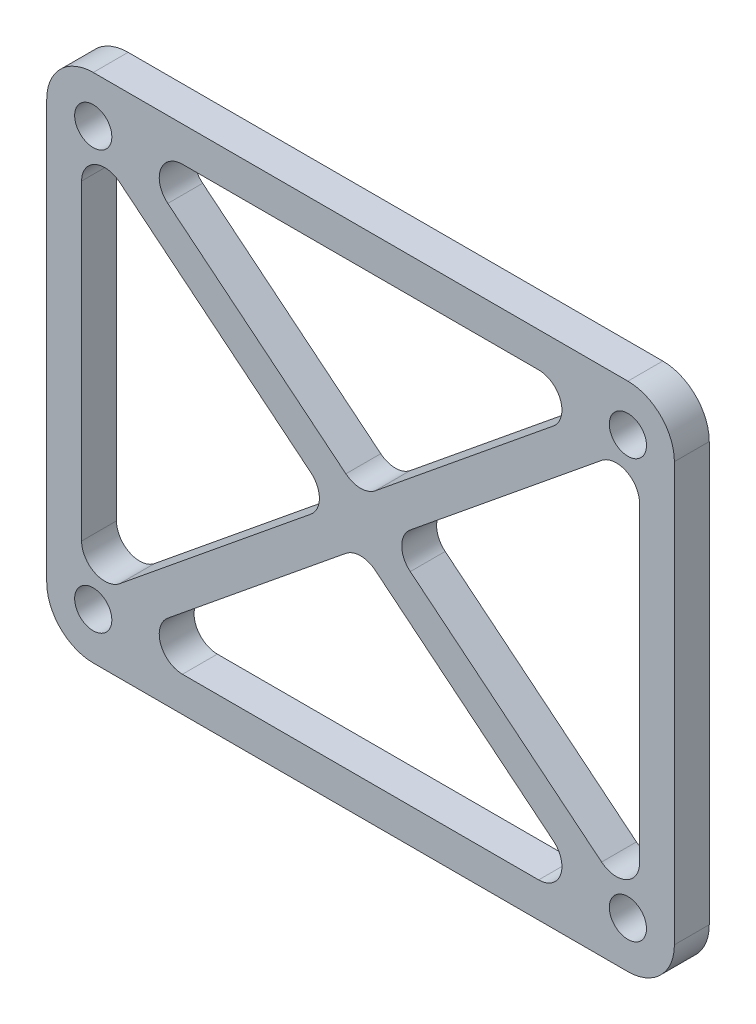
ISO-10303-21;
HEADER;
FILE_DESCRIPTION(('STEP AP214'),'2;1');
FILE_NAME('part.step','',(''),(''),'','','');
FILE_SCHEMA(('AUTOMOTIVE_DESIGN { 1 0 10303 214 1 1 1 1 }'));
ENDSEC;
DATA;
#1=APPLICATION_CONTEXT('core data for automotive mechanical design processes');
#2=APPLICATION_PROTOCOL_DEFINITION('international standard','automotive_design',2000,#1);
#3=PRODUCT_CONTEXT('',#1,'mechanical');
#4=PRODUCT('Part','Part','',(#3));
#5=PRODUCT_RELATED_PRODUCT_CATEGORY('part','',(#4));
#6=PRODUCT_DEFINITION_FORMATION('','',#4);
#7=PRODUCT_DEFINITION_CONTEXT('part definition',#1,'design');
#8=PRODUCT_DEFINITION('design','',#6,#7);
#9=PRODUCT_DEFINITION_SHAPE('','',#8);
#10=(LENGTH_UNIT() NAMED_UNIT(*) SI_UNIT(.MILLI.,.METRE.));
#11=(NAMED_UNIT(*) PLANE_ANGLE_UNIT() SI_UNIT($,.RADIAN.));
#12=(NAMED_UNIT(*) SI_UNIT($,.STERADIAN.) SOLID_ANGLE_UNIT());
#13=UNCERTAINTY_MEASURE_WITH_UNIT(LENGTH_MEASURE(1.E-05),#10,'distance_accuracy_value','');
#14=(GEOMETRIC_REPRESENTATION_CONTEXT(3) GLOBAL_UNCERTAINTY_ASSIGNED_CONTEXT((#13)) GLOBAL_UNIT_ASSIGNED_CONTEXT((#10,
#11,#12)) REPRESENTATION_CONTEXT('',''));
#15=CARTESIAN_POINT('',(0.,0.,0.));
#16=DIRECTION('',(0.,0.,1.));
#17=DIRECTION('',(1.,0.,0.));
#18=AXIS2_PLACEMENT_3D('',#15,#16,#17);
#19=CARTESIAN_POINT('',(0.,0.,3.));
#20=DIRECTION('',(0.,0.,-1.));
#21=DIRECTION('',(-1.,0.,0.));
#22=AXIS2_PLACEMENT_3D('',#19,#20,#21);
#23=PLANE('',#22);
#24=DIRECTION('',(-0.77523498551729,-0.631672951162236,0.));
#25=VECTOR('',#24,1.);
#26=CARTESIAN_POINT('',(0.947509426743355,-1.16285247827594,3.));
#27=LINE('',#26,#25);
#28=CARTESIAN_POINT('',(20.7366540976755,14.9616357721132,3.));
#29=VERTEX_POINT('',#28);
#30=CARTESIAN_POINT('',(4.27749606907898,1.55046997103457,3.));
#31=VERTEX_POINT('',#30);
#32=EDGE_CURVE('E285',#29,#31,#27,.T.);
#33=ORIENTED_EDGE('',*,*,#32,.F.);
#34=CARTESIAN_POINT('',(22.,13.4111658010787,3.));
#35=DIRECTION('',(0.,0.,-1.));
#36=DIRECTION('',(-1.,0.,0.));
#37=AXIS2_PLACEMENT_3D('',#34,#35,#36);
#38=CIRCLE('',#37,2.);
#39=CARTESIAN_POINT('',(24.,13.4111658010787,3.));
#40=VERTEX_POINT('',#39);
#41=EDGE_CURVE('E253',#40,#29,#38,.F.);
#42=ORIENTED_EDGE('',*,*,#41,.F.);
#43=DIRECTION('',(0.,-1.,0.));
#44=VECTOR('',#43,1.);
#45=CARTESIAN_POINT('',(24.,0.,3.));
#46=LINE('',#45,#44);
#47=CARTESIAN_POINT('',(24.,-13.4111658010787,3.));
#48=VERTEX_POINT('',#47);
#49=EDGE_CURVE('E271',#40,#48,#46,.T.);
#50=ORIENTED_EDGE('',*,*,#49,.T.);
#51=CARTESIAN_POINT('',(22.,-13.4111658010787,3.));
#52=DIRECTION('',(0.,0.,-1.));
#53=DIRECTION('',(-1.,0.,0.));
#54=AXIS2_PLACEMENT_3D('',#51,#52,#53);
#55=CIRCLE('',#54,2.);
#56=CARTESIAN_POINT('',(20.7366540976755,-14.9616357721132,3.));
#57=VERTEX_POINT('',#56);
#58=EDGE_CURVE('E274',#48,#57,#55,.T.);
#59=ORIENTED_EDGE('',*,*,#58,.T.);
#60=DIRECTION('',(0.77523498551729,-0.631672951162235,0.));
#61=VECTOR('',#60,1.);
#62=CARTESIAN_POINT('',(0.947509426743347,1.16285247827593,3.));
#63=LINE('',#62,#61);
#64=CARTESIAN_POINT('',(4.27749606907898,-1.55046997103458,3.));
#65=VERTEX_POINT('',#64);
#66=EDGE_CURVE('E290',#65,#57,#63,.T.);
#67=ORIENTED_EDGE('',*,*,#66,.F.);
#68=CARTESIAN_POINT('',(5.54084197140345,0.,3.));
#69=DIRECTION('',(0.,0.,-1.));
#70=DIRECTION('',(-1.,0.,0.));
#71=AXIS2_PLACEMENT_3D('',#68,#69,#70);
#72=CIRCLE('',#71,2.);
#73=EDGE_CURVE('E287',#31,#65,#72,.F.);
#74=ORIENTED_EDGE('',*,*,#73,.F.);
#75=EDGE_LOOP('',(#33,#42,#50,#59,#67,#74));
#76=FACE_BOUND('',#75,.T.);
#77=DIRECTION('',(-1.,0.,0.));
#78=VECTOR('',#77,1.);
#79=CARTESIAN_POINT('',(15.3227943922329,-19.,3.));
#80=LINE('',#79,#78);
#81=CARTESIAN_POINT('',(15.3227943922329,-19.,3.));
#82=VERTEX_POINT('',#81);
#83=CARTESIAN_POINT('',(-15.3227943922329,-19.,3.));
#84=VERTEX_POINT('',#83);
#85=EDGE_CURVE('E309',#82,#84,#80,.T.);
#86=ORIENTED_EDGE('',*,*,#85,.T.);
#87=CARTESIAN_POINT('',(-15.3227943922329,-17.,3.));
#88=DIRECTION('',(0.,0.,1.));
#89=DIRECTION('',(-1.,0.,0.));
#90=AXIS2_PLACEMENT_3D('',#87,#88,#89);
#91=CIRCLE('',#90,2.);
#92=CARTESIAN_POINT('',(-16.5861402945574,-15.4495300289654,3.));
#93=VERTEX_POINT('',#92);
#94=EDGE_CURVE('E297',#93,#84,#91,.T.);
#95=ORIENTED_EDGE('',*,*,#94,.F.);
#96=DIRECTION('',(0.775234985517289,0.631672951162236,0.));
#97=VECTOR('',#96,1.);
#98=CARTESIAN_POINT('',(-16.5861402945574,-15.4495300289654,3.));
#99=LINE('',#98,#97);
#100=CARTESIAN_POINT('',(-1.26334590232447,-2.96429015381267,3.));
#101=VERTEX_POINT('',#100);
#102=EDGE_CURVE('E322',#93,#101,#99,.T.);
#103=ORIENTED_EDGE('',*,*,#102,.T.);
#104=CARTESIAN_POINT('',(0.,-4.51476012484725,3.));
#105=DIRECTION('',(0.,0.,-1.));
#106=DIRECTION('',(1.,0.,0.));
#107=AXIS2_PLACEMENT_3D('',#104,#105,#106);
#108=CIRCLE('',#107,2.);
#109=CARTESIAN_POINT('',(1.26334590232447,-2.96429015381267,3.));
#110=VERTEX_POINT('',#109);
#111=EDGE_CURVE('E325',#101,#110,#108,.T.);
#112=ORIENTED_EDGE('',*,*,#111,.T.);
#113=DIRECTION('',(0.77523498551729,-0.631672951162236,0.));
#114=VECTOR('',#113,1.);
#115=CARTESIAN_POINT('',(1.26334590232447,-2.96429015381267,3.));
#116=LINE('',#115,#114);
#117=CARTESIAN_POINT('',(16.5861402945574,-15.4495300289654,3.));
#118=VERTEX_POINT('',#117);
#119=EDGE_CURVE('E328',#110,#118,#116,.T.);
#120=ORIENTED_EDGE('',*,*,#119,.T.);
#121=CARTESIAN_POINT('',(15.3227943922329,-17.,3.));
#122=DIRECTION('',(0.,0.,-1.));
#123=DIRECTION('',(1.,0.,0.));
#124=AXIS2_PLACEMENT_3D('',#121,#122,#123);
#125=CIRCLE('',#124,2.);
#126=EDGE_CURVE('E331',#118,#82,#125,.T.);
#127=ORIENTED_EDGE('',*,*,#126,.T.);
#128=EDGE_LOOP('',(#86,#95,#103,#112,#120,#127));
#129=FACE_BOUND('',#128,.T.);
#130=CARTESIAN_POINT('',(-15.3227943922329,17.,3.));
#131=DIRECTION('',(0.,0.,-1.));
#132=DIRECTION('',(-1.,0.,0.));
#133=AXIS2_PLACEMENT_3D('',#130,#131,#132);
#134=CIRCLE('',#133,2.);
#135=CARTESIAN_POINT('',(-16.5861402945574,15.4495300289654,3.));
#136=VERTEX_POINT('',#135);
#137=CARTESIAN_POINT('',(-15.3227943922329,19.,3.));
#138=VERTEX_POINT('',#137);
#139=EDGE_CURVE('E384',#136,#138,#134,.T.);
#140=ORIENTED_EDGE('',*,*,#139,.T.);
#141=DIRECTION('',(-1.,0.,0.));
#142=VECTOR('',#141,1.);
#143=CARTESIAN_POINT('',(15.3227943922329,19.,3.));
#144=LINE('',#143,#142);
#145=CARTESIAN_POINT('',(15.3227943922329,19.,3.));
#146=VERTEX_POINT('',#145);
#147=EDGE_CURVE('E416',#146,#138,#144,.T.);
#148=ORIENTED_EDGE('',*,*,#147,.F.);
#149=CARTESIAN_POINT('',(15.3227943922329,17.,3.));
#150=DIRECTION('',(0.,0.,1.));
#151=DIRECTION('',(1.,0.,0.));
#152=AXIS2_PLACEMENT_3D('',#149,#150,#151);
#153=CIRCLE('',#152,2.);
#154=CARTESIAN_POINT('',(16.5861402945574,15.4495300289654,3.));
#155=VERTEX_POINT('',#154);
#156=EDGE_CURVE('E419',#155,#146,#153,.T.);
#157=ORIENTED_EDGE('',*,*,#156,.F.);
#158=DIRECTION('',(0.77523498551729,0.631672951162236,0.));
#159=VECTOR('',#158,1.);
#160=CARTESIAN_POINT('',(1.26334590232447,2.96429015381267,3.));
#161=LINE('',#160,#159);
#162=CARTESIAN_POINT('',(1.26334590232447,2.96429015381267,3.));
#163=VERTEX_POINT('',#162);
#164=EDGE_CURVE('E422',#163,#155,#161,.T.);
#165=ORIENTED_EDGE('',*,*,#164,.F.);
#166=CARTESIAN_POINT('',(0.,4.51476012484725,3.));
#167=DIRECTION('',(0.,0.,1.));
#168=DIRECTION('',(1.,0.,0.));
#169=AXIS2_PLACEMENT_3D('',#166,#167,#168);
#170=CIRCLE('',#169,2.);
#171=CARTESIAN_POINT('',(-1.26334590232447,2.96429015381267,3.));
#172=VERTEX_POINT('',#171);
#173=EDGE_CURVE('E425',#172,#163,#170,.T.);
#174=ORIENTED_EDGE('',*,*,#173,.F.);
#175=DIRECTION('',(0.775234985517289,-0.631672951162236,0.));
#176=VECTOR('',#175,1.);
#177=CARTESIAN_POINT('',(-16.5861402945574,15.4495300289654,3.));
#178=LINE('',#177,#176);
#179=EDGE_CURVE('E398',#136,#172,#178,.T.);
#180=ORIENTED_EDGE('',*,*,#179,.F.);
#181=EDGE_LOOP('',(#140,#148,#157,#165,#174,#180));
#182=FACE_BOUND('',#181,.T.);
#183=DIRECTION('',(0.,-1.,0.));
#184=VECTOR('',#183,1.);
#185=CARTESIAN_POINT('',(-27.,-22.,3.));
#186=LINE('',#185,#184);
#187=CARTESIAN_POINT('',(-27.,18.,3.));
#188=VERTEX_POINT('',#187);
#189=CARTESIAN_POINT('',(-27.,-18.,3.));
#190=VERTEX_POINT('',#189);
#191=EDGE_CURVE('E472',#188,#190,#186,.T.);
#192=ORIENTED_EDGE('',*,*,#191,.T.);
#193=CARTESIAN_POINT('',(-23.,-18.,3.));
#194=DIRECTION('',(0.,0.,-1.));
#195=DIRECTION('',(-1.,0.,0.));
#196=AXIS2_PLACEMENT_3D('',#193,#194,#195);
#197=CIRCLE('',#196,4.);
#198=CARTESIAN_POINT('',(-23.,-22.,3.));
#199=VERTEX_POINT('',#198);
#200=EDGE_CURVE('E510',#190,#199,#197,.F.);
#201=ORIENTED_EDGE('',*,*,#200,.T.);
#202=DIRECTION('',(1.,0.,0.));
#203=VECTOR('',#202,1.);
#204=CARTESIAN_POINT('',(-27.,-22.,3.));
#205=LINE('',#204,#203);
#206=CARTESIAN_POINT('',(23.,-22.,3.));
#207=VERTEX_POINT('',#206);
#208=EDGE_CURVE('E475',#199,#207,#205,.T.);
#209=ORIENTED_EDGE('',*,*,#208,.T.);
#210=CARTESIAN_POINT('',(23.,-18.,3.));
#211=DIRECTION('',(0.,0.,-1.));
#212=DIRECTION('',(-1.,0.,0.));
#213=AXIS2_PLACEMENT_3D('',#210,#211,#212);
#214=CIRCLE('',#213,4.);
#215=CARTESIAN_POINT('',(27.,-18.,3.));
#216=VERTEX_POINT('',#215);
#217=EDGE_CURVE('E508',#207,#216,#214,.F.);
#218=ORIENTED_EDGE('',*,*,#217,.T.);
#219=DIRECTION('',(0.,1.,0.));
#220=VECTOR('',#219,1.);
#221=CARTESIAN_POINT('',(27.,-22.,3.));
#222=LINE('',#221,#220);
#223=CARTESIAN_POINT('',(27.,18.,3.));
#224=VERTEX_POINT('',#223);
#225=EDGE_CURVE('E467',#216,#224,#222,.T.);
#226=ORIENTED_EDGE('',*,*,#225,.T.);
#227=CARTESIAN_POINT('',(23.,18.,3.));
#228=DIRECTION('',(0.,0.,-1.));
#229=DIRECTION('',(-1.,0.,0.));
#230=AXIS2_PLACEMENT_3D('',#227,#228,#229);
#231=CIRCLE('',#230,4.);
#232=CARTESIAN_POINT('',(23.,22.,3.));
#233=VERTEX_POINT('',#232);
#234=EDGE_CURVE('E57',#224,#233,#231,.F.);
#235=ORIENTED_EDGE('',*,*,#234,.T.);
#236=DIRECTION('',(-1.,0.,0.));
#237=VECTOR('',#236,1.);
#238=CARTESIAN_POINT('',(-27.,22.,3.));
#239=LINE('',#238,#237);
#240=CARTESIAN_POINT('',(-23.,22.,3.));
#241=VERTEX_POINT('',#240);
#242=EDGE_CURVE('E469',#233,#241,#239,.T.);
#243=ORIENTED_EDGE('',*,*,#242,.T.);
#244=CARTESIAN_POINT('',(-23.,18.,3.));
#245=DIRECTION('',(0.,0.,-1.));
#246=DIRECTION('',(-1.,0.,0.));
#247=AXIS2_PLACEMENT_3D('',#244,#245,#246);
#248=CIRCLE('',#247,4.);
#249=EDGE_CURVE('E505',#241,#188,#248,.F.);
#250=ORIENTED_EDGE('',*,*,#249,.T.);
#251=EDGE_LOOP('',(#192,#201,#209,#218,#226,#235,#243,#250));
#252=FACE_BOUND('',#251,.T.);
#253=CARTESIAN_POINT('',(-23.,18.,3.));
#254=DIRECTION('',(0.,0.,1.));
#255=DIRECTION('',(1.,0.,0.));
#256=AXIS2_PLACEMENT_3D('',#253,#254,#255);
#257=CIRCLE('',#256,1.6);
#258=CARTESIAN_POINT('',(-21.4,18.,3.));
#259=VERTEX_POINT('',#258);
#260=EDGE_CURVE('E461',#259,#259,#257,.T.);
#261=ORIENTED_EDGE('',*,*,#260,.F.);
#262=EDGE_LOOP('',(#261));
#263=FACE_BOUND('',#262,.T.);
#264=CARTESIAN_POINT('',(23.,18.,3.));
#265=DIRECTION('',(0.,0.,1.));
#266=DIRECTION('',(1.,0.,0.));
#267=AXIS2_PLACEMENT_3D('',#264,#265,#266);
#268=CIRCLE('',#267,1.6);
#269=CARTESIAN_POINT('',(24.6,18.,3.));
#270=VERTEX_POINT('',#269);
#271=EDGE_CURVE('E455',#270,#270,#268,.T.);
#272=ORIENTED_EDGE('',*,*,#271,.F.);
#273=EDGE_LOOP('',(#272));
#274=FACE_BOUND('',#273,.T.);
#275=CARTESIAN_POINT('',(23.,-18.,3.));
#276=DIRECTION('',(0.,0.,1.));
#277=DIRECTION('',(1.,0.,0.));
#278=AXIS2_PLACEMENT_3D('',#275,#276,#277);
#279=CIRCLE('',#278,1.6);
#280=CARTESIAN_POINT('',(24.6,-18.,3.));
#281=VERTEX_POINT('',#280);
#282=EDGE_CURVE('E449',#281,#281,#279,.T.);
#283=ORIENTED_EDGE('',*,*,#282,.F.);
#284=EDGE_LOOP('',(#283));
#285=FACE_BOUND('',#284,.T.);
#286=CARTESIAN_POINT('',(-23.,-18.,3.));
#287=DIRECTION('',(0.,0.,1.));
#288=DIRECTION('',(1.,0.,0.));
#289=AXIS2_PLACEMENT_3D('',#286,#287,#288);
#290=CIRCLE('',#289,1.6);
#291=CARTESIAN_POINT('',(-21.4,-18.,3.));
#292=VERTEX_POINT('',#291);
#293=EDGE_CURVE('E443',#292,#292,#290,.T.);
#294=ORIENTED_EDGE('',*,*,#293,.F.);
#295=EDGE_LOOP('',(#294));
#296=FACE_BOUND('',#295,.T.);
#297=CARTESIAN_POINT('',(-22.,13.4111658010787,3.));
#298=DIRECTION('',(0.,0.,1.));
#299=DIRECTION('',(1.,0.,0.));
#300=AXIS2_PLACEMENT_3D('',#297,#298,#299);
#301=CIRCLE('',#300,2.);
#302=CARTESIAN_POINT('',(-24.,13.4111658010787,3.));
#303=VERTEX_POINT('',#302);
#304=CARTESIAN_POINT('',(-20.7366540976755,14.9616357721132,3.));
#305=VERTEX_POINT('',#304);
#306=EDGE_CURVE('E348',#303,#305,#301,.F.);
#307=ORIENTED_EDGE('',*,*,#306,.T.);
#308=DIRECTION('',(0.77523498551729,-0.631672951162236,0.));
#309=VECTOR('',#308,1.);
#310=CARTESIAN_POINT('',(-0.947509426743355,-1.16285247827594,3.));
#311=LINE('',#310,#309);
#312=CARTESIAN_POINT('',(-4.27749606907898,1.55046997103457,3.));
#313=VERTEX_POINT('',#312);
#314=EDGE_CURVE('E352',#305,#313,#311,.T.);
#315=ORIENTED_EDGE('',*,*,#314,.T.);
#316=CARTESIAN_POINT('',(-5.54084197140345,0.,3.));
#317=DIRECTION('',(0.,0.,1.));
#318=DIRECTION('',(1.,0.,0.));
#319=AXIS2_PLACEMENT_3D('',#316,#317,#318);
#320=CIRCLE('',#319,2.);
#321=CARTESIAN_POINT('',(-4.27749606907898,-1.55046997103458,3.));
#322=VERTEX_POINT('',#321);
#323=EDGE_CURVE('E376',#313,#322,#320,.F.);
#324=ORIENTED_EDGE('',*,*,#323,.T.);
#325=DIRECTION('',(-0.77523498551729,-0.631672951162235,0.));
#326=VECTOR('',#325,1.);
#327=CARTESIAN_POINT('',(-0.947509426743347,1.16285247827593,3.));
#328=LINE('',#327,#326);
#329=CARTESIAN_POINT('',(-20.7366540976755,-14.9616357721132,3.));
#330=VERTEX_POINT('',#329);
#331=EDGE_CURVE('E373',#322,#330,#328,.T.);
#332=ORIENTED_EDGE('',*,*,#331,.T.);
#333=CARTESIAN_POINT('',(-22.,-13.4111658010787,3.));
#334=DIRECTION('',(0.,0.,1.));
#335=DIRECTION('',(1.,0.,0.));
#336=AXIS2_PLACEMENT_3D('',#333,#334,#335);
#337=CIRCLE('',#336,2.);
#338=CARTESIAN_POINT('',(-24.,-13.4111658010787,3.));
#339=VERTEX_POINT('',#338);
#340=EDGE_CURVE('E370',#339,#330,#337,.T.);
#341=ORIENTED_EDGE('',*,*,#340,.F.);
#342=DIRECTION('',(0.,-1.,0.));
#343=VECTOR('',#342,1.);
#344=CARTESIAN_POINT('',(-24.,0.,3.));
#345=LINE('',#344,#343);
#346=EDGE_CURVE('E367',#303,#339,#345,.T.);
#347=ORIENTED_EDGE('',*,*,#346,.F.);
#348=EDGE_LOOP('',(#307,#315,#324,#332,#341,#347));
#349=FACE_BOUND('',#348,.T.);
#350=ADVANCED_FACE('F36',(#76,#129,#182,#252,#263,#274,#285,#296,#349),#23,.F.);
#351=CARTESIAN_POINT('',(0.,0.,0.));
#352=DIRECTION('',(0.,0.,-1.));
#353=DIRECTION('',(-1.,0.,0.));
#354=AXIS2_PLACEMENT_3D('',#351,#352,#353);
#355=PLANE('',#354);
#356=CARTESIAN_POINT('',(22.,13.4111658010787,0.));
#357=DIRECTION('',(0.,0.,-1.));
#358=DIRECTION('',(-1.,0.,0.));
#359=AXIS2_PLACEMENT_3D('',#356,#357,#358);
#360=CIRCLE('',#359,2.);
#361=CARTESIAN_POINT('',(24.,13.4111658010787,0.));
#362=VERTEX_POINT('',#361);
#363=CARTESIAN_POINT('',(20.7366540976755,14.9616357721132,0.));
#364=VERTEX_POINT('',#363);
#365=EDGE_CURVE('E250',#362,#364,#360,.F.);
#366=ORIENTED_EDGE('',*,*,#365,.T.);
#367=DIRECTION('',(-0.77523498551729,-0.631672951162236,0.));
#368=VECTOR('',#367,1.);
#369=CARTESIAN_POINT('',(0.947509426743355,-1.16285247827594,0.));
#370=LINE('',#369,#368);
#371=CARTESIAN_POINT('',(4.27749606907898,1.55046997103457,0.));
#372=VERTEX_POINT('',#371);
#373=EDGE_CURVE('E262',#364,#372,#370,.T.);
#374=ORIENTED_EDGE('',*,*,#373,.T.);
#375=CARTESIAN_POINT('',(5.54084197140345,0.,0.));
#376=DIRECTION('',(0.,0.,-1.));
#377=DIRECTION('',(-1.,0.,0.));
#378=AXIS2_PLACEMENT_3D('',#375,#376,#377);
#379=CIRCLE('',#378,2.);
#380=CARTESIAN_POINT('',(4.27749606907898,-1.55046997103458,0.));
#381=VERTEX_POINT('',#380);
#382=EDGE_CURVE('E266',#372,#381,#379,.F.);
#383=ORIENTED_EDGE('',*,*,#382,.T.);
#384=DIRECTION('',(0.77523498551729,-0.631672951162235,0.));
#385=VECTOR('',#384,1.);
#386=CARTESIAN_POINT('',(0.947509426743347,1.16285247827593,0.));
#387=LINE('',#386,#385);
#388=CARTESIAN_POINT('',(20.7366540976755,-14.9616357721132,0.));
#389=VERTEX_POINT('',#388);
#390=EDGE_CURVE('E278',#381,#389,#387,.T.);
#391=ORIENTED_EDGE('',*,*,#390,.T.);
#392=CARTESIAN_POINT('',(22.,-13.4111658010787,0.));
#393=DIRECTION('',(0.,0.,-1.));
#394=DIRECTION('',(-1.,0.,0.));
#395=AXIS2_PLACEMENT_3D('',#392,#393,#394);
#396=CIRCLE('',#395,2.);
#397=CARTESIAN_POINT('',(24.,-13.4111658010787,0.));
#398=VERTEX_POINT('',#397);
#399=EDGE_CURVE('E281',#398,#389,#396,.T.);
#400=ORIENTED_EDGE('',*,*,#399,.F.);
#401=DIRECTION('',(0.,-1.,0.));
#402=VECTOR('',#401,1.);
#403=CARTESIAN_POINT('',(24.,0.,0.));
#404=LINE('',#403,#402);
#405=EDGE_CURVE('E258',#362,#398,#404,.T.);
#406=ORIENTED_EDGE('',*,*,#405,.F.);
#407=EDGE_LOOP('',(#366,#374,#383,#391,#400,#406));
#408=FACE_BOUND('',#407,.T.);
#409=CARTESIAN_POINT('',(-15.3227943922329,-17.,0.));
#410=DIRECTION('',(0.,0.,1.));
#411=DIRECTION('',(-1.,0.,0.));
#412=AXIS2_PLACEMENT_3D('',#409,#410,#411);
#413=CIRCLE('',#412,2.);
#414=CARTESIAN_POINT('',(-16.5861402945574,-15.4495300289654,0.));
#415=VERTEX_POINT('',#414);
#416=CARTESIAN_POINT('',(-15.3227943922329,-19.,0.));
#417=VERTEX_POINT('',#416);
#418=EDGE_CURVE('E305',#415,#417,#413,.T.);
#419=ORIENTED_EDGE('',*,*,#418,.T.);
#420=DIRECTION('',(-1.,0.,0.));
#421=VECTOR('',#420,1.);
#422=CARTESIAN_POINT('',(15.3227943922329,-19.,0.));
#423=LINE('',#422,#421);
#424=CARTESIAN_POINT('',(15.3227943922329,-19.,0.));
#425=VERTEX_POINT('',#424);
#426=EDGE_CURVE('E318',#425,#417,#423,.T.);
#427=ORIENTED_EDGE('',*,*,#426,.F.);
#428=CARTESIAN_POINT('',(15.3227943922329,-17.,0.));
#429=DIRECTION('',(0.,0.,-1.));
#430=DIRECTION('',(1.,0.,0.));
#431=AXIS2_PLACEMENT_3D('',#428,#429,#430);
#432=CIRCLE('',#431,2.);
#433=CARTESIAN_POINT('',(16.5861402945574,-15.4495300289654,0.));
#434=VERTEX_POINT('',#433);
#435=EDGE_CURVE('E315',#434,#425,#432,.T.);
#436=ORIENTED_EDGE('',*,*,#435,.F.);
#437=DIRECTION('',(0.77523498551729,-0.631672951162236,0.));
#438=VECTOR('',#437,1.);
#439=CARTESIAN_POINT('',(1.26334590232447,-2.96429015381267,0.));
#440=LINE('',#439,#438);
#441=CARTESIAN_POINT('',(1.26334590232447,-2.96429015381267,0.));
#442=VERTEX_POINT('',#441);
#443=EDGE_CURVE('E313',#442,#434,#440,.T.);
#444=ORIENTED_EDGE('',*,*,#443,.F.);
#445=CARTESIAN_POINT('',(0.,-4.51476012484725,0.));
#446=DIRECTION('',(0.,0.,-1.));
#447=DIRECTION('',(1.,0.,0.));
#448=AXIS2_PLACEMENT_3D('',#445,#446,#447);
#449=CIRCLE('',#448,2.);
#450=CARTESIAN_POINT('',(-1.26334590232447,-2.96429015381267,0.));
#451=VERTEX_POINT('',#450);
#452=EDGE_CURVE('E311',#451,#442,#449,.T.);
#453=ORIENTED_EDGE('',*,*,#452,.F.);
#454=DIRECTION('',(0.775234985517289,0.631672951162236,0.));
#455=VECTOR('',#454,1.);
#456=CARTESIAN_POINT('',(-16.5861402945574,-15.4495300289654,0.));
#457=LINE('',#456,#455);
#458=EDGE_CURVE('E308',#415,#451,#457,.T.);
#459=ORIENTED_EDGE('',*,*,#458,.F.);
#460=EDGE_LOOP('',(#419,#427,#436,#444,#453,#459));
#461=FACE_BOUND('',#460,.T.);
#462=CARTESIAN_POINT('',(23.,-18.,0.));
#463=DIRECTION('',(0.,0.,1.));
#464=DIRECTION('',(1.,0.,0.));
#465=AXIS2_PLACEMENT_3D('',#462,#463,#464);
#466=CIRCLE('',#465,1.6);
#467=CARTESIAN_POINT('',(24.6,-18.,0.));
#468=VERTEX_POINT('',#467);
#469=EDGE_CURVE('E446',#468,#468,#466,.T.);
#470=ORIENTED_EDGE('',*,*,#469,.T.);
#471=EDGE_LOOP('',(#470));
#472=FACE_BOUND('',#471,.T.);
#473=CARTESIAN_POINT('',(-23.,18.,0.));
#474=DIRECTION('',(0.,0.,1.));
#475=DIRECTION('',(1.,0.,0.));
#476=AXIS2_PLACEMENT_3D('',#473,#474,#475);
#477=CIRCLE('',#476,1.6);
#478=CARTESIAN_POINT('',(-21.4,18.,0.));
#479=VERTEX_POINT('',#478);
#480=EDGE_CURVE('E458',#479,#479,#477,.T.);
#481=ORIENTED_EDGE('',*,*,#480,.T.);
#482=EDGE_LOOP('',(#481));
#483=FACE_BOUND('',#482,.T.);
#484=DIRECTION('',(1.,0.,0.));
#485=VECTOR('',#484,1.);
#486=CARTESIAN_POINT('',(-27.,-22.,0.));
#487=LINE('',#486,#485);
#488=CARTESIAN_POINT('',(-23.,-22.,0.));
#489=VERTEX_POINT('',#488);
#490=CARTESIAN_POINT('',(23.,-22.,0.));
#491=VERTEX_POINT('',#490);
#492=EDGE_CURVE('E470',#489,#491,#487,.T.);
#493=ORIENTED_EDGE('',*,*,#492,.F.);
#494=CARTESIAN_POINT('',(-23.,-18.,0.));
#495=DIRECTION('',(0.,0.,-1.));
#496=DIRECTION('',(-1.,0.,0.));
#497=AXIS2_PLACEMENT_3D('',#494,#495,#496);
#498=CIRCLE('',#497,4.);
#499=CARTESIAN_POINT('',(-27.,-18.,0.));
#500=VERTEX_POINT('',#499);
#501=EDGE_CURVE('E498',#489,#500,#498,.T.);
#502=ORIENTED_EDGE('',*,*,#501,.T.);
#503=DIRECTION('',(0.,-1.,0.));
#504=VECTOR('',#503,1.);
#505=CARTESIAN_POINT('',(-27.,-22.,0.));
#506=LINE('',#505,#504);
#507=CARTESIAN_POINT('',(-27.,18.,0.));
#508=VERTEX_POINT('',#507);
#509=EDGE_CURVE('E483',#508,#500,#506,.T.);
#510=ORIENTED_EDGE('',*,*,#509,.F.);
#511=CARTESIAN_POINT('',(-23.,18.,0.));
#512=DIRECTION('',(0.,0.,-1.));
#513=DIRECTION('',(-1.,0.,0.));
#514=AXIS2_PLACEMENT_3D('',#511,#512,#513);
#515=CIRCLE('',#514,4.);
#516=CARTESIAN_POINT('',(-23.,22.,0.));
#517=VERTEX_POINT('',#516);
#518=EDGE_CURVE('E492',#508,#517,#515,.T.);
#519=ORIENTED_EDGE('',*,*,#518,.T.);
#520=DIRECTION('',(-1.,0.,0.));
#521=VECTOR('',#520,1.);
#522=CARTESIAN_POINT('',(-27.,22.,0.));
#523=LINE('',#522,#521);
#524=CARTESIAN_POINT('',(23.,22.,0.));
#525=VERTEX_POINT('',#524);
#526=EDGE_CURVE('E481',#525,#517,#523,.T.);
#527=ORIENTED_EDGE('',*,*,#526,.F.);
#528=CARTESIAN_POINT('',(23.,18.,0.));
#529=DIRECTION('',(0.,0.,-1.));
#530=DIRECTION('',(-1.,0.,0.));
#531=AXIS2_PLACEMENT_3D('',#528,#529,#530);
#532=CIRCLE('',#531,4.);
#533=CARTESIAN_POINT('',(27.,18.,0.));
#534=VERTEX_POINT('',#533);
#535=EDGE_CURVE('E494',#525,#534,#532,.T.);
#536=ORIENTED_EDGE('',*,*,#535,.T.);
#537=DIRECTION('',(0.,1.,0.));
#538=VECTOR('',#537,1.);
#539=CARTESIAN_POINT('',(27.,-22.,0.));
#540=LINE('',#539,#538);
#541=CARTESIAN_POINT('',(27.,-18.,0.));
#542=VERTEX_POINT('',#541);
#543=EDGE_CURVE('E464',#542,#534,#540,.T.);
#544=ORIENTED_EDGE('',*,*,#543,.F.);
#545=CARTESIAN_POINT('',(23.,-18.,0.));
#546=DIRECTION('',(0.,0.,-1.));
#547=DIRECTION('',(-1.,0.,0.));
#548=AXIS2_PLACEMENT_3D('',#545,#546,#547);
#549=CIRCLE('',#548,4.);
#550=EDGE_CURVE('E496',#542,#491,#549,.T.);
#551=ORIENTED_EDGE('',*,*,#550,.T.);
#552=EDGE_LOOP('',(#493,#502,#510,#519,#527,#536,#544,#551));
#553=FACE_BOUND('',#552,.T.);
#554=CARTESIAN_POINT('',(23.,18.,0.));
#555=DIRECTION('',(0.,0.,1.));
#556=DIRECTION('',(1.,0.,0.));
#557=AXIS2_PLACEMENT_3D('',#554,#555,#556);
#558=CIRCLE('',#557,1.6);
#559=CARTESIAN_POINT('',(24.6,18.,0.));
#560=VERTEX_POINT('',#559);
#561=EDGE_CURVE('E452',#560,#560,#558,.T.);
#562=ORIENTED_EDGE('',*,*,#561,.T.);
#563=EDGE_LOOP('',(#562));
#564=FACE_BOUND('',#563,.T.);
#565=CARTESIAN_POINT('',(-23.,-18.,0.));
#566=DIRECTION('',(0.,0.,1.));
#567=DIRECTION('',(1.,0.,0.));
#568=AXIS2_PLACEMENT_3D('',#565,#566,#567);
#569=CIRCLE('',#568,1.6);
#570=CARTESIAN_POINT('',(-21.4,-18.,0.));
#571=VERTEX_POINT('',#570);
#572=EDGE_CURVE('E442',#571,#571,#569,.T.);
#573=ORIENTED_EDGE('',*,*,#572,.T.);
#574=EDGE_LOOP('',(#573));
#575=FACE_BOUND('',#574,.T.);
#576=DIRECTION('',(-1.,0.,0.));
#577=VECTOR('',#576,1.);
#578=CARTESIAN_POINT('',(15.3227943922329,19.,0.));
#579=LINE('',#578,#577);
#580=CARTESIAN_POINT('',(15.3227943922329,19.,0.));
#581=VERTEX_POINT('',#580);
#582=CARTESIAN_POINT('',(-15.3227943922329,19.,0.));
#583=VERTEX_POINT('',#582);
#584=EDGE_CURVE('E397',#581,#583,#579,.T.);
#585=ORIENTED_EDGE('',*,*,#584,.T.);
#586=CARTESIAN_POINT('',(-15.3227943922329,17.,0.));
#587=DIRECTION('',(0.,0.,-1.));
#588=DIRECTION('',(-1.,0.,0.));
#589=AXIS2_PLACEMENT_3D('',#586,#587,#588);
#590=CIRCLE('',#589,2.);
#591=CARTESIAN_POINT('',(-16.5861402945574,15.4495300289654,0.));
#592=VERTEX_POINT('',#591);
#593=EDGE_CURVE('E395',#592,#583,#590,.T.);
#594=ORIENTED_EDGE('',*,*,#593,.F.);
#595=DIRECTION('',(0.775234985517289,-0.631672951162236,0.));
#596=VECTOR('',#595,1.);
#597=CARTESIAN_POINT('',(-16.5861402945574,15.4495300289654,0.));
#598=LINE('',#597,#596);
#599=CARTESIAN_POINT('',(-1.26334590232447,2.96429015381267,0.));
#600=VERTEX_POINT('',#599);
#601=EDGE_CURVE('E410',#592,#600,#598,.T.);
#602=ORIENTED_EDGE('',*,*,#601,.T.);
#603=CARTESIAN_POINT('',(0.,4.51476012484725,0.));
#604=DIRECTION('',(0.,0.,1.));
#605=DIRECTION('',(1.,0.,0.));
#606=AXIS2_PLACEMENT_3D('',#603,#604,#605);
#607=CIRCLE('',#606,2.);
#608=CARTESIAN_POINT('',(1.26334590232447,2.96429015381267,0.));
#609=VERTEX_POINT('',#608);
#610=EDGE_CURVE('E407',#600,#609,#607,.T.);
#611=ORIENTED_EDGE('',*,*,#610,.T.);
#612=DIRECTION('',(0.77523498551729,0.631672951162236,0.));
#613=VECTOR('',#612,1.);
#614=CARTESIAN_POINT('',(1.26334590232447,2.96429015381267,0.));
#615=LINE('',#614,#613);
#616=CARTESIAN_POINT('',(16.5861402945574,15.4495300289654,0.));
#617=VERTEX_POINT('',#616);
#618=EDGE_CURVE('E404',#609,#617,#615,.T.);
#619=ORIENTED_EDGE('',*,*,#618,.T.);
#620=CARTESIAN_POINT('',(15.3227943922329,17.,0.));
#621=DIRECTION('',(0.,0.,1.));
#622=DIRECTION('',(1.,0.,0.));
#623=AXIS2_PLACEMENT_3D('',#620,#621,#622);
#624=CIRCLE('',#623,2.);
#625=EDGE_CURVE('E401',#617,#581,#624,.T.);
#626=ORIENTED_EDGE('',*,*,#625,.T.);
#627=EDGE_LOOP('',(#585,#594,#602,#611,#619,#626));
#628=FACE_BOUND('',#627,.T.);
#629=DIRECTION('',(0.77523498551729,-0.631672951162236,0.));
#630=VECTOR('',#629,1.);
#631=CARTESIAN_POINT('',(-0.947509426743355,-1.16285247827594,0.));
#632=LINE('',#631,#630);
#633=CARTESIAN_POINT('',(-20.7366540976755,14.9616357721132,0.));
#634=VERTEX_POINT('',#633);
#635=CARTESIAN_POINT('',(-4.27749606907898,1.55046997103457,0.));
#636=VERTEX_POINT('',#635);
#637=EDGE_CURVE('E362',#634,#636,#632,.T.);
#638=ORIENTED_EDGE('',*,*,#637,.F.);
#639=CARTESIAN_POINT('',(-22.,13.4111658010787,0.));
#640=DIRECTION('',(0.,0.,1.));
#641=DIRECTION('',(1.,0.,0.));
#642=AXIS2_PLACEMENT_3D('',#639,#640,#641);
#643=CIRCLE('',#642,2.);
#644=CARTESIAN_POINT('',(-24.,13.4111658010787,0.));
#645=VERTEX_POINT('',#644);
#646=EDGE_CURVE('E349',#645,#634,#643,.F.);
#647=ORIENTED_EDGE('',*,*,#646,.F.);
#648=DIRECTION('',(0.,-1.,0.));
#649=VECTOR('',#648,1.);
#650=CARTESIAN_POINT('',(-24.,0.,0.));
#651=LINE('',#650,#649);
#652=CARTESIAN_POINT('',(-24.,-13.4111658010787,0.));
#653=VERTEX_POINT('',#652);
#654=EDGE_CURVE('E351',#645,#653,#651,.T.);
#655=ORIENTED_EDGE('',*,*,#654,.T.);
#656=CARTESIAN_POINT('',(-22.,-13.4111658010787,0.));
#657=DIRECTION('',(0.,0.,1.));
#658=DIRECTION('',(1.,0.,0.));
#659=AXIS2_PLACEMENT_3D('',#656,#657,#658);
#660=CIRCLE('',#659,2.);
#661=CARTESIAN_POINT('',(-20.7366540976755,-14.9616357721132,0.));
#662=VERTEX_POINT('',#661);
#663=EDGE_CURVE('E355',#653,#662,#660,.T.);
#664=ORIENTED_EDGE('',*,*,#663,.T.);
#665=DIRECTION('',(-0.77523498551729,-0.631672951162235,0.));
#666=VECTOR('',#665,1.);
#667=CARTESIAN_POINT('',(-0.947509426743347,1.16285247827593,0.));
#668=LINE('',#667,#666);
#669=CARTESIAN_POINT('',(-4.27749606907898,-1.55046997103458,0.));
#670=VERTEX_POINT('',#669);
#671=EDGE_CURVE('E358',#670,#662,#668,.T.);
#672=ORIENTED_EDGE('',*,*,#671,.F.);
#673=CARTESIAN_POINT('',(-5.54084197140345,0.,0.));
#674=DIRECTION('',(0.,0.,1.));
#675=DIRECTION('',(1.,0.,0.));
#676=AXIS2_PLACEMENT_3D('',#673,#674,#675);
#677=CIRCLE('',#676,2.);
#678=EDGE_CURVE('E360',#636,#670,#677,.F.);
#679=ORIENTED_EDGE('',*,*,#678,.F.);
#680=EDGE_LOOP('',(#638,#647,#655,#664,#672,#679));
#681=FACE_BOUND('',#680,.T.);
#682=ADVANCED_FACE('F268',(#408,#461,#472,#483,#553,#564,#575,#628,#681),#355,.T.);
#683=CARTESIAN_POINT('',(27.,-22.,3.));
#684=DIRECTION('',(-1.,0.,0.));
#685=DIRECTION('',(0.,0.,1.));
#686=AXIS2_PLACEMENT_3D('',#683,#684,#685);
#687=PLANE('',#686);
#688=ORIENTED_EDGE('',*,*,#225,.F.);
#689=DIRECTION('',(0.,0.,-1.));
#690=VECTOR('',#689,1.);
#691=CARTESIAN_POINT('',(27.,-18.,3.));
#692=LINE('',#691,#690);
#693=EDGE_CURVE('E514',#216,#542,#692,.T.);
#694=ORIENTED_EDGE('',*,*,#693,.T.);
#695=ORIENTED_EDGE('',*,*,#543,.T.);
#696=DIRECTION('',(0.,0.,-1.));
#697=VECTOR('',#696,1.);
#698=CARTESIAN_POINT('',(27.,18.,3.));
#699=LINE('',#698,#697);
#700=EDGE_CURVE('E512',#534,#224,#699,.F.);
#701=ORIENTED_EDGE('',*,*,#700,.T.);
#702=EDGE_LOOP('',(#688,#694,#695,#701));
#703=FACE_BOUND('',#702,.T.);
#704=ADVANCED_FACE('F520',(#703),#687,.F.);
#705=CARTESIAN_POINT('',(-27.,22.,3.));
#706=DIRECTION('',(0.,-1.,0.));
#707=DIRECTION('',(0.,0.,-1.));
#708=AXIS2_PLACEMENT_3D('',#705,#706,#707);
#709=PLANE('',#708);
#710=ORIENTED_EDGE('',*,*,#242,.F.);
#711=DIRECTION('',(0.,0.,-1.));
#712=VECTOR('',#711,1.);
#713=CARTESIAN_POINT('',(23.,22.,3.));
#714=LINE('',#713,#712);
#715=EDGE_CURVE('E11',#233,#525,#714,.T.);
#716=ORIENTED_EDGE('',*,*,#715,.T.);
#717=ORIENTED_EDGE('',*,*,#526,.T.);
#718=DIRECTION('',(0.,0.,-1.));
#719=VECTOR('',#718,1.);
#720=CARTESIAN_POINT('',(-23.,22.,3.));
#721=LINE('',#720,#719);
#722=EDGE_CURVE('E44',#517,#241,#721,.F.);
#723=ORIENTED_EDGE('',*,*,#722,.T.);
#724=EDGE_LOOP('',(#710,#716,#717,#723));
#725=FACE_BOUND('',#724,.T.);
#726=ADVANCED_FACE('F531',(#725),#709,.F.);
#727=CARTESIAN_POINT('',(-27.,-22.,3.));
#728=DIRECTION('',(1.,0.,0.));
#729=DIRECTION('',(0.,0.,-1.));
#730=AXIS2_PLACEMENT_3D('',#727,#728,#729);
#731=PLANE('',#730);
#732=ORIENTED_EDGE('',*,*,#509,.T.);
#733=DIRECTION('',(0.,0.,-1.));
#734=VECTOR('',#733,1.);
#735=CARTESIAN_POINT('',(-27.,-18.,3.));
#736=LINE('',#735,#734);
#737=EDGE_CURVE('E503',#500,#190,#736,.F.);
#738=ORIENTED_EDGE('',*,*,#737,.T.);
#739=ORIENTED_EDGE('',*,*,#191,.F.);
#740=DIRECTION('',(0.,0.,-1.));
#741=VECTOR('',#740,1.);
#742=CARTESIAN_POINT('',(-27.,18.,3.));
#743=LINE('',#742,#741);
#744=EDGE_CURVE('E500',#188,#508,#743,.T.);
#745=ORIENTED_EDGE('',*,*,#744,.T.);
#746=EDGE_LOOP('',(#732,#738,#739,#745));
#747=FACE_BOUND('',#746,.T.);
#748=ADVANCED_FACE('F539',(#747),#731,.F.);
#749=CARTESIAN_POINT('',(-27.,-22.,3.));
#750=DIRECTION('',(0.,1.,0.));
#751=DIRECTION('',(0.,0.,1.));
#752=AXIS2_PLACEMENT_3D('',#749,#750,#751);
#753=PLANE('',#752);
#754=ORIENTED_EDGE('',*,*,#208,.F.);
#755=DIRECTION('',(0.,0.,-1.));
#756=VECTOR('',#755,1.);
#757=CARTESIAN_POINT('',(-23.,-22.,3.));
#758=LINE('',#757,#756);
#759=EDGE_CURVE('E489',#199,#489,#758,.T.);
#760=ORIENTED_EDGE('',*,*,#759,.T.);
#761=ORIENTED_EDGE('',*,*,#492,.T.);
#762=DIRECTION('',(0.,0.,-1.));
#763=VECTOR('',#762,1.);
#764=CARTESIAN_POINT('',(23.,-22.,3.));
#765=LINE('',#764,#763);
#766=EDGE_CURVE('E478',#491,#207,#765,.F.);
#767=ORIENTED_EDGE('',*,*,#766,.T.);
#768=EDGE_LOOP('',(#754,#760,#761,#767));
#769=FACE_BOUND('',#768,.T.);
#770=ADVANCED_FACE('F547',(#769),#753,.F.);
#771=CARTESIAN_POINT('',(-23.,18.,3.));
#772=DIRECTION('',(0.,0.,-1.));
#773=DIRECTION('',(-1.,0.,0.));
#774=AXIS2_PLACEMENT_3D('',#771,#772,#773);
#775=CYLINDRICAL_SURFACE('',#774,1.6);
#776=ORIENTED_EDGE('',*,*,#260,.T.);
#777=EDGE_LOOP('',(#776));
#778=FACE_BOUND('',#777,.T.);
#779=ORIENTED_EDGE('',*,*,#480,.F.);
#780=EDGE_LOOP('',(#779));
#781=FACE_BOUND('',#780,.T.);
#782=ADVANCED_FACE('F567',(#778,#781),#775,.F.);
#783=CARTESIAN_POINT('',(23.,18.,3.));
#784=DIRECTION('',(0.,0.,-1.));
#785=DIRECTION('',(-1.,0.,0.));
#786=AXIS2_PLACEMENT_3D('',#783,#784,#785);
#787=CYLINDRICAL_SURFACE('',#786,1.6);
#788=ORIENTED_EDGE('',*,*,#271,.T.);
#789=EDGE_LOOP('',(#788));
#790=FACE_BOUND('',#789,.T.);
#791=ORIENTED_EDGE('',*,*,#561,.F.);
#792=EDGE_LOOP('',(#791));
#793=FACE_BOUND('',#792,.T.);
#794=ADVANCED_FACE('F827',(#790,#793),#787,.F.);
#795=CARTESIAN_POINT('',(23.,-18.,3.));
#796=DIRECTION('',(0.,0.,-1.));
#797=DIRECTION('',(-1.,0.,0.));
#798=AXIS2_PLACEMENT_3D('',#795,#796,#797);
#799=CYLINDRICAL_SURFACE('',#798,1.6);
#800=ORIENTED_EDGE('',*,*,#282,.T.);
#801=EDGE_LOOP('',(#800));
#802=FACE_BOUND('',#801,.T.);
#803=ORIENTED_EDGE('',*,*,#469,.F.);
#804=EDGE_LOOP('',(#803));
#805=FACE_BOUND('',#804,.T.);
#806=ADVANCED_FACE('F819',(#802,#805),#799,.F.);
#807=CARTESIAN_POINT('',(-23.,-18.,3.));
#808=DIRECTION('',(0.,0.,-1.));
#809=DIRECTION('',(-1.,0.,0.));
#810=AXIS2_PLACEMENT_3D('',#807,#808,#809);
#811=CYLINDRICAL_SURFACE('',#810,1.6);
#812=ORIENTED_EDGE('',*,*,#293,.T.);
#813=EDGE_LOOP('',(#812));
#814=FACE_BOUND('',#813,.T.);
#815=ORIENTED_EDGE('',*,*,#572,.F.);
#816=EDGE_LOOP('',(#815));
#817=FACE_BOUND('',#816,.T.);
#818=ADVANCED_FACE('F802',(#814,#817),#811,.F.);
#819=CARTESIAN_POINT('',(-15.3227943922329,17.,0.));
#820=DIRECTION('',(0.,0.,1.));
#821=DIRECTION('',(1.,0.,0.));
#822=AXIS2_PLACEMENT_3D('',#819,#820,#821);
#823=CYLINDRICAL_SURFACE('',#822,2.);
#824=ORIENTED_EDGE('',*,*,#139,.F.);
#825=DIRECTION('',(0.,0.,1.));
#826=VECTOR('',#825,1.);
#827=CARTESIAN_POINT('',(-16.5861402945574,15.4495300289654,0.));
#828=LINE('',#827,#826);
#829=EDGE_CURVE('E413',#592,#136,#828,.T.);
#830=ORIENTED_EDGE('',*,*,#829,.F.);
#831=ORIENTED_EDGE('',*,*,#593,.T.);
#832=DIRECTION('',(0.,0.,1.));
#833=VECTOR('',#832,1.);
#834=CARTESIAN_POINT('',(-15.3227943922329,19.,0.));
#835=LINE('',#834,#833);
#836=EDGE_CURVE('E440',#583,#138,#835,.T.);
#837=ORIENTED_EDGE('',*,*,#836,.T.);
#838=EDGE_LOOP('',(#824,#830,#831,#837));
#839=FACE_BOUND('',#838,.T.);
#840=ADVANCED_FACE('F795',(#839),#823,.F.);
#841=CARTESIAN_POINT('',(15.3227943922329,19.,0.));
#842=DIRECTION('',(0.,1.,0.));
#843=DIRECTION('',(-1.,0.,0.));
#844=AXIS2_PLACEMENT_3D('',#841,#842,#843);
#845=PLANE('',#844);
#846=ORIENTED_EDGE('',*,*,#147,.T.);
#847=ORIENTED_EDGE('',*,*,#836,.F.);
#848=ORIENTED_EDGE('',*,*,#584,.F.);
#849=DIRECTION('',(0.,0.,1.));
#850=VECTOR('',#849,1.);
#851=CARTESIAN_POINT('',(15.3227943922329,19.,0.));
#852=LINE('',#851,#850);
#853=EDGE_CURVE('E438',#581,#146,#852,.T.);
#854=ORIENTED_EDGE('',*,*,#853,.T.);
#855=EDGE_LOOP('',(#846,#847,#848,#854));
#856=FACE_BOUND('',#855,.T.);
#857=ADVANCED_FACE('F787',(#856),#845,.F.);
#858=CARTESIAN_POINT('',(15.3227943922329,17.,0.));
#859=DIRECTION('',(0.,0.,1.));
#860=DIRECTION('',(1.,0.,0.));
#861=AXIS2_PLACEMENT_3D('',#858,#859,#860);
#862=CYLINDRICAL_SURFACE('',#861,2.);
#863=ORIENTED_EDGE('',*,*,#156,.T.);
#864=ORIENTED_EDGE('',*,*,#853,.F.);
#865=ORIENTED_EDGE('',*,*,#625,.F.);
#866=DIRECTION('',(0.,0.,1.));
#867=VECTOR('',#866,1.);
#868=CARTESIAN_POINT('',(16.5861402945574,15.4495300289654,0.));
#869=LINE('',#868,#867);
#870=EDGE_CURVE('E436',#617,#155,#869,.T.);
#871=ORIENTED_EDGE('',*,*,#870,.T.);
#872=EDGE_LOOP('',(#863,#864,#865,#871));
#873=FACE_BOUND('',#872,.T.);
#874=ADVANCED_FACE('F779',(#873),#862,.F.);
#875=CARTESIAN_POINT('',(1.26334590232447,2.96429015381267,0.));
#876=DIRECTION('',(0.631672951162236,-0.775234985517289,0.));
#877=DIRECTION('',(0.77523498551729,0.631672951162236,0.));
#878=AXIS2_PLACEMENT_3D('',#875,#876,#877);
#879=PLANE('',#878);
#880=ORIENTED_EDGE('',*,*,#164,.T.);
#881=ORIENTED_EDGE('',*,*,#870,.F.);
#882=ORIENTED_EDGE('',*,*,#618,.F.);
#883=DIRECTION('',(0.,0.,1.));
#884=VECTOR('',#883,1.);
#885=CARTESIAN_POINT('',(1.26334590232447,2.96429015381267,0.));
#886=LINE('',#885,#884);
#887=EDGE_CURVE('E434',#609,#163,#886,.T.);
#888=ORIENTED_EDGE('',*,*,#887,.T.);
#889=EDGE_LOOP('',(#880,#881,#882,#888));
#890=FACE_BOUND('',#889,.T.);
#891=ADVANCED_FACE('F771',(#890),#879,.F.);
#892=CARTESIAN_POINT('',(0.,4.51476012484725,0.));
#893=DIRECTION('',(0.,0.,1.));
#894=DIRECTION('',(1.,0.,0.));
#895=AXIS2_PLACEMENT_3D('',#892,#893,#894);
#896=CYLINDRICAL_SURFACE('',#895,2.);
#897=ORIENTED_EDGE('',*,*,#173,.T.);
#898=ORIENTED_EDGE('',*,*,#887,.F.);
#899=ORIENTED_EDGE('',*,*,#610,.F.);
#900=DIRECTION('',(0.,0.,1.));
#901=VECTOR('',#900,1.);
#902=CARTESIAN_POINT('',(-1.26334590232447,2.96429015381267,0.));
#903=LINE('',#902,#901);
#904=EDGE_CURVE('E432',#600,#172,#903,.T.);
#905=ORIENTED_EDGE('',*,*,#904,.T.);
#906=EDGE_LOOP('',(#897,#898,#899,#905));
#907=FACE_BOUND('',#906,.T.);
#908=ADVANCED_FACE('F763',(#907),#896,.F.);
#909=CARTESIAN_POINT('',(-16.5861402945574,15.4495300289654,0.));
#910=DIRECTION('',(-0.631672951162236,-0.775234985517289,0.));
#911=DIRECTION('',(0.775234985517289,-0.631672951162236,0.));
#912=AXIS2_PLACEMENT_3D('',#909,#910,#911);
#913=PLANE('',#912);
#914=ORIENTED_EDGE('',*,*,#179,.T.);
#915=ORIENTED_EDGE('',*,*,#904,.F.);
#916=ORIENTED_EDGE('',*,*,#601,.F.);
#917=ORIENTED_EDGE('',*,*,#829,.T.);
#918=EDGE_LOOP('',(#914,#915,#916,#917));
#919=FACE_BOUND('',#918,.T.);
#920=ADVANCED_FACE('F755',(#919),#913,.F.);
#921=CARTESIAN_POINT('',(-22.,13.4111658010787,0.));
#922=DIRECTION('',(0.,0.,1.));
#923=DIRECTION('',(1.,0.,0.));
#924=AXIS2_PLACEMENT_3D('',#921,#922,#923);
#925=CYLINDRICAL_SURFACE('',#924,2.);
#926=ORIENTED_EDGE('',*,*,#306,.F.);
#927=DIRECTION('',(0.,0.,1.));
#928=VECTOR('',#927,1.);
#929=CARTESIAN_POINT('',(-24.,13.4111658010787,0.));
#930=LINE('',#929,#928);
#931=EDGE_CURVE('E364',#645,#303,#930,.T.);
#932=ORIENTED_EDGE('',*,*,#931,.F.);
#933=ORIENTED_EDGE('',*,*,#646,.T.);
#934=DIRECTION('',(0.,0.,1.));
#935=VECTOR('',#934,1.);
#936=CARTESIAN_POINT('',(-20.7366540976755,14.9616357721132,0.));
#937=LINE('',#936,#935);
#938=EDGE_CURVE('E381',#634,#305,#937,.T.);
#939=ORIENTED_EDGE('',*,*,#938,.T.);
#940=EDGE_LOOP('',(#926,#932,#933,#939));
#941=FACE_BOUND('',#940,.T.);
#942=ADVANCED_FACE('F747',(#941),#925,.F.);
#943=CARTESIAN_POINT('',(-0.947509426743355,-1.16285247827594,0.));
#944=DIRECTION('',(-0.631672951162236,-0.775234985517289,0.));
#945=DIRECTION('',(0.77523498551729,-0.631672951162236,0.));
#946=AXIS2_PLACEMENT_3D('',#943,#944,#945);
#947=PLANE('',#946);
#948=ORIENTED_EDGE('',*,*,#314,.F.);
#949=ORIENTED_EDGE('',*,*,#938,.F.);
#950=ORIENTED_EDGE('',*,*,#637,.T.);
#951=DIRECTION('',(0.,0.,1.));
#952=VECTOR('',#951,1.);
#953=CARTESIAN_POINT('',(-4.27749606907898,1.55046997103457,0.));
#954=LINE('',#953,#952);
#955=EDGE_CURVE('E385',#636,#313,#954,.T.);
#956=ORIENTED_EDGE('',*,*,#955,.T.);
#957=EDGE_LOOP('',(#948,#949,#950,#956));
#958=FACE_BOUND('',#957,.T.);
#959=ADVANCED_FACE('F739',(#958),#947,.T.);
#960=CARTESIAN_POINT('',(-5.54084197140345,0.,0.));
#961=DIRECTION('',(0.,0.,1.));
#962=DIRECTION('',(1.,0.,0.));
#963=AXIS2_PLACEMENT_3D('',#960,#961,#962);
#964=CYLINDRICAL_SURFACE('',#963,2.);
#965=ORIENTED_EDGE('',*,*,#323,.F.);
#966=ORIENTED_EDGE('',*,*,#955,.F.);
#967=ORIENTED_EDGE('',*,*,#678,.T.);
#968=DIRECTION('',(0.,0.,1.));
#969=VECTOR('',#968,1.);
#970=CARTESIAN_POINT('',(-4.27749606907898,-1.55046997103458,0.));
#971=LINE('',#970,#969);
#972=EDGE_CURVE('E387',#670,#322,#971,.T.);
#973=ORIENTED_EDGE('',*,*,#972,.T.);
#974=EDGE_LOOP('',(#965,#966,#967,#973));
#975=FACE_BOUND('',#974,.T.);
#976=ADVANCED_FACE('F731',(#975),#964,.F.);
#977=CARTESIAN_POINT('',(-0.947509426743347,1.16285247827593,0.));
#978=DIRECTION('',(-0.631672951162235,0.77523498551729,0.));
#979=DIRECTION('',(-0.77523498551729,-0.631672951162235,0.));
#980=AXIS2_PLACEMENT_3D('',#977,#978,#979);
#981=PLANE('',#980);
#982=ORIENTED_EDGE('',*,*,#331,.F.);
#983=ORIENTED_EDGE('',*,*,#972,.F.);
#984=ORIENTED_EDGE('',*,*,#671,.T.);
#985=DIRECTION('',(0.,0.,1.));
#986=VECTOR('',#985,1.);
#987=CARTESIAN_POINT('',(-20.7366540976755,-14.9616357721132,0.));
#988=LINE('',#987,#986);
#989=EDGE_CURVE('E389',#662,#330,#988,.T.);
#990=ORIENTED_EDGE('',*,*,#989,.T.);
#991=EDGE_LOOP('',(#982,#983,#984,#990));
#992=FACE_BOUND('',#991,.T.);
#993=ADVANCED_FACE('F723',(#992),#981,.T.);
#994=CARTESIAN_POINT('',(-22.,-13.4111658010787,0.));
#995=DIRECTION('',(0.,0.,1.));
#996=DIRECTION('',(1.,0.,0.));
#997=AXIS2_PLACEMENT_3D('',#994,#995,#996);
#998=CYLINDRICAL_SURFACE('',#997,2.);
#999=ORIENTED_EDGE('',*,*,#340,.T.);
#1000=ORIENTED_EDGE('',*,*,#989,.F.);
#1001=ORIENTED_EDGE('',*,*,#663,.F.);
#1002=DIRECTION('',(0.,0.,1.));
#1003=VECTOR('',#1002,1.);
#1004=CARTESIAN_POINT('',(-24.,-13.4111658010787,0.));
#1005=LINE('',#1004,#1003);
#1006=EDGE_CURVE('E391',#653,#339,#1005,.T.);
#1007=ORIENTED_EDGE('',*,*,#1006,.T.);
#1008=EDGE_LOOP('',(#999,#1000,#1001,#1007));
#1009=FACE_BOUND('',#1008,.T.);
#1010=ADVANCED_FACE('F715',(#1009),#998,.F.);
#1011=CARTESIAN_POINT('',(-24.,0.,0.));
#1012=DIRECTION('',(-1.,0.,0.));
#1013=DIRECTION('',(0.,0.,1.));
#1014=AXIS2_PLACEMENT_3D('',#1011,#1012,#1013);
#1015=PLANE('',#1014);
#1016=ORIENTED_EDGE('',*,*,#346,.T.);
#1017=ORIENTED_EDGE('',*,*,#1006,.F.);
#1018=ORIENTED_EDGE('',*,*,#654,.F.);
#1019=ORIENTED_EDGE('',*,*,#931,.T.);
#1020=EDGE_LOOP('',(#1016,#1017,#1018,#1019));
#1021=FACE_BOUND('',#1020,.T.);
#1022=ADVANCED_FACE('F707',(#1021),#1015,.F.);
#1023=CARTESIAN_POINT('',(-15.3227943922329,-17.,0.));
#1024=DIRECTION('',(0.,0.,1.));
#1025=DIRECTION('',(1.,0.,0.));
#1026=AXIS2_PLACEMENT_3D('',#1023,#1024,#1025);
#1027=CYLINDRICAL_SURFACE('',#1026,2.);
#1028=ORIENTED_EDGE('',*,*,#94,.T.);
#1029=DIRECTION('',(0.,0.,1.));
#1030=VECTOR('',#1029,1.);
#1031=CARTESIAN_POINT('',(-15.3227943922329,-19.,0.));
#1032=LINE('',#1031,#1030);
#1033=EDGE_CURVE('E320',#417,#84,#1032,.T.);
#1034=ORIENTED_EDGE('',*,*,#1033,.F.);
#1035=ORIENTED_EDGE('',*,*,#418,.F.);
#1036=DIRECTION('',(0.,0.,1.));
#1037=VECTOR('',#1036,1.);
#1038=CARTESIAN_POINT('',(-16.5861402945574,-15.4495300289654,0.));
#1039=LINE('',#1038,#1037);
#1040=EDGE_CURVE('E346',#415,#93,#1039,.T.);
#1041=ORIENTED_EDGE('',*,*,#1040,.T.);
#1042=EDGE_LOOP('',(#1028,#1034,#1035,#1041));
#1043=FACE_BOUND('',#1042,.T.);
#1044=ADVANCED_FACE('F699',(#1043),#1027,.F.);
#1045=CARTESIAN_POINT('',(-16.5861402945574,-15.4495300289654,0.));
#1046=DIRECTION('',(0.631672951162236,-0.775234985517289,0.));
#1047=DIRECTION('',(0.775234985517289,0.631672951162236,0.));
#1048=AXIS2_PLACEMENT_3D('',#1045,#1046,#1047);
#1049=PLANE('',#1048);
#1050=ORIENTED_EDGE('',*,*,#102,.F.);
#1051=ORIENTED_EDGE('',*,*,#1040,.F.);
#1052=ORIENTED_EDGE('',*,*,#458,.T.);
#1053=DIRECTION('',(0.,0.,1.));
#1054=VECTOR('',#1053,1.);
#1055=CARTESIAN_POINT('',(-1.26334590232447,-2.96429015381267,0.));
#1056=LINE('',#1055,#1054);
#1057=EDGE_CURVE('E344',#451,#101,#1056,.T.);
#1058=ORIENTED_EDGE('',*,*,#1057,.T.);
#1059=EDGE_LOOP('',(#1050,#1051,#1052,#1058));
#1060=FACE_BOUND('',#1059,.T.);
#1061=ADVANCED_FACE('F691',(#1060),#1049,.T.);
#1062=CARTESIAN_POINT('',(0.,-4.51476012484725,0.));
#1063=DIRECTION('',(0.,0.,1.));
#1064=DIRECTION('',(1.,0.,0.));
#1065=AXIS2_PLACEMENT_3D('',#1062,#1063,#1064);
#1066=CYLINDRICAL_SURFACE('',#1065,2.);
#1067=ORIENTED_EDGE('',*,*,#111,.F.);
#1068=ORIENTED_EDGE('',*,*,#1057,.F.);
#1069=ORIENTED_EDGE('',*,*,#452,.T.);
#1070=DIRECTION('',(0.,0.,1.));
#1071=VECTOR('',#1070,1.);
#1072=CARTESIAN_POINT('',(1.26334590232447,-2.96429015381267,0.));
#1073=LINE('',#1072,#1071);
#1074=EDGE_CURVE('E342',#442,#110,#1073,.T.);
#1075=ORIENTED_EDGE('',*,*,#1074,.T.);
#1076=EDGE_LOOP('',(#1067,#1068,#1069,#1075));
#1077=FACE_BOUND('',#1076,.T.);
#1078=ADVANCED_FACE('F683',(#1077),#1066,.F.);
#1079=CARTESIAN_POINT('',(1.26334590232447,-2.96429015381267,0.));
#1080=DIRECTION('',(-0.631672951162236,-0.775234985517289,0.));
#1081=DIRECTION('',(0.77523498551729,-0.631672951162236,0.));
#1082=AXIS2_PLACEMENT_3D('',#1079,#1080,#1081);
#1083=PLANE('',#1082);
#1084=ORIENTED_EDGE('',*,*,#119,.F.);
#1085=ORIENTED_EDGE('',*,*,#1074,.F.);
#1086=ORIENTED_EDGE('',*,*,#443,.T.);
#1087=DIRECTION('',(0.,0.,1.));
#1088=VECTOR('',#1087,1.);
#1089=CARTESIAN_POINT('',(16.5861402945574,-15.4495300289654,0.));
#1090=LINE('',#1089,#1088);
#1091=EDGE_CURVE('E340',#434,#118,#1090,.T.);
#1092=ORIENTED_EDGE('',*,*,#1091,.T.);
#1093=EDGE_LOOP('',(#1084,#1085,#1086,#1092));
#1094=FACE_BOUND('',#1093,.T.);
#1095=ADVANCED_FACE('F675',(#1094),#1083,.T.);
#1096=CARTESIAN_POINT('',(15.3227943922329,-17.,0.));
#1097=DIRECTION('',(0.,0.,1.));
#1098=DIRECTION('',(1.,0.,0.));
#1099=AXIS2_PLACEMENT_3D('',#1096,#1097,#1098);
#1100=CYLINDRICAL_SURFACE('',#1099,2.);
#1101=ORIENTED_EDGE('',*,*,#126,.F.);
#1102=ORIENTED_EDGE('',*,*,#1091,.F.);
#1103=ORIENTED_EDGE('',*,*,#435,.T.);
#1104=DIRECTION('',(0.,0.,1.));
#1105=VECTOR('',#1104,1.);
#1106=CARTESIAN_POINT('',(15.3227943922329,-19.,0.));
#1107=LINE('',#1106,#1105);
#1108=EDGE_CURVE('E338',#425,#82,#1107,.T.);
#1109=ORIENTED_EDGE('',*,*,#1108,.T.);
#1110=EDGE_LOOP('',(#1101,#1102,#1103,#1109));
#1111=FACE_BOUND('',#1110,.T.);
#1112=ADVANCED_FACE('F667',(#1111),#1100,.F.);
#1113=CARTESIAN_POINT('',(15.3227943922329,-19.,0.));
#1114=DIRECTION('',(0.,1.,0.));
#1115=DIRECTION('',(-1.,0.,0.));
#1116=AXIS2_PLACEMENT_3D('',#1113,#1114,#1115);
#1117=PLANE('',#1116);
#1118=ORIENTED_EDGE('',*,*,#85,.F.);
#1119=ORIENTED_EDGE('',*,*,#1108,.F.);
#1120=ORIENTED_EDGE('',*,*,#426,.T.);
#1121=ORIENTED_EDGE('',*,*,#1033,.T.);
#1122=EDGE_LOOP('',(#1118,#1119,#1120,#1121));
#1123=FACE_BOUND('',#1122,.T.);
#1124=ADVANCED_FACE('F660',(#1123),#1117,.T.);
#1125=CARTESIAN_POINT('',(22.,13.4111658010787,0.));
#1126=DIRECTION('',(0.,0.,1.));
#1127=DIRECTION('',(1.,0.,0.));
#1128=AXIS2_PLACEMENT_3D('',#1125,#1126,#1127);
#1129=CYLINDRICAL_SURFACE('',#1128,2.);
#1130=ORIENTED_EDGE('',*,*,#41,.T.);
#1131=DIRECTION('',(0.,0.,1.));
#1132=VECTOR('',#1131,1.);
#1133=CARTESIAN_POINT('',(20.7366540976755,14.9616357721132,0.));
#1134=LINE('',#1133,#1132);
#1135=EDGE_CURVE('E246',#364,#29,#1134,.T.);
#1136=ORIENTED_EDGE('',*,*,#1135,.F.);
#1137=ORIENTED_EDGE('',*,*,#365,.F.);
#1138=DIRECTION('',(0.,0.,1.));
#1139=VECTOR('',#1138,1.);
#1140=CARTESIAN_POINT('',(24.,13.4111658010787,0.));
#1141=LINE('',#1140,#1139);
#1142=EDGE_CURVE('E295',#362,#40,#1141,.T.);
#1143=ORIENTED_EDGE('',*,*,#1142,.T.);
#1144=EDGE_LOOP('',(#1130,#1136,#1137,#1143));
#1145=FACE_BOUND('',#1144,.T.);
#1146=ADVANCED_FACE('F248',(#1145),#1129,.F.);
#1147=CARTESIAN_POINT('',(24.,0.,0.));
#1148=DIRECTION('',(-1.,0.,0.));
#1149=DIRECTION('',(0.,0.,1.));
#1150=AXIS2_PLACEMENT_3D('',#1147,#1148,#1149);
#1151=PLANE('',#1150);
#1152=ORIENTED_EDGE('',*,*,#49,.F.);
#1153=ORIENTED_EDGE('',*,*,#1142,.F.);
#1154=ORIENTED_EDGE('',*,*,#405,.T.);
#1155=DIRECTION('',(0.,0.,1.));
#1156=VECTOR('',#1155,1.);
#1157=CARTESIAN_POINT('',(24.,-13.4111658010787,0.));
#1158=LINE('',#1157,#1156);
#1159=EDGE_CURVE('E298',#398,#48,#1158,.T.);
#1160=ORIENTED_EDGE('',*,*,#1159,.T.);
#1161=EDGE_LOOP('',(#1152,#1153,#1154,#1160));
#1162=FACE_BOUND('',#1161,.T.);
#1163=ADVANCED_FACE('F645',(#1162),#1151,.T.);
#1164=CARTESIAN_POINT('',(22.,-13.4111658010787,0.));
#1165=DIRECTION('',(0.,0.,1.));
#1166=DIRECTION('',(1.,0.,0.));
#1167=AXIS2_PLACEMENT_3D('',#1164,#1165,#1166);
#1168=CYLINDRICAL_SURFACE('',#1167,2.);
#1169=ORIENTED_EDGE('',*,*,#58,.F.);
#1170=ORIENTED_EDGE('',*,*,#1159,.F.);
#1171=ORIENTED_EDGE('',*,*,#399,.T.);
#1172=DIRECTION('',(0.,0.,1.));
#1173=VECTOR('',#1172,1.);
#1174=CARTESIAN_POINT('',(20.7366540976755,-14.9616357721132,0.));
#1175=LINE('',#1174,#1173);
#1176=EDGE_CURVE('E300',#389,#57,#1175,.T.);
#1177=ORIENTED_EDGE('',*,*,#1176,.T.);
#1178=EDGE_LOOP('',(#1169,#1170,#1171,#1177));
#1179=FACE_BOUND('',#1178,.T.);
#1180=ADVANCED_FACE('F637',(#1179),#1168,.F.);
#1181=CARTESIAN_POINT('',(0.947509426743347,1.16285247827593,0.));
#1182=DIRECTION('',(-0.631672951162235,-0.77523498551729,0.));
#1183=DIRECTION('',(0.77523498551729,-0.631672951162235,0.));
#1184=AXIS2_PLACEMENT_3D('',#1181,#1182,#1183);
#1185=PLANE('',#1184);
#1186=ORIENTED_EDGE('',*,*,#66,.T.);
#1187=ORIENTED_EDGE('',*,*,#1176,.F.);
#1188=ORIENTED_EDGE('',*,*,#390,.F.);
#1189=DIRECTION('',(0.,0.,1.));
#1190=VECTOR('',#1189,1.);
#1191=CARTESIAN_POINT('',(4.27749606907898,-1.55046997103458,0.));
#1192=LINE('',#1191,#1190);
#1193=EDGE_CURVE('E302',#381,#65,#1192,.T.);
#1194=ORIENTED_EDGE('',*,*,#1193,.T.);
#1195=EDGE_LOOP('',(#1186,#1187,#1188,#1194));
#1196=FACE_BOUND('',#1195,.T.);
#1197=ADVANCED_FACE('F629',(#1196),#1185,.F.);
#1198=CARTESIAN_POINT('',(5.54084197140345,0.,0.));
#1199=DIRECTION('',(0.,0.,1.));
#1200=DIRECTION('',(1.,0.,0.));
#1201=AXIS2_PLACEMENT_3D('',#1198,#1199,#1200);
#1202=CYLINDRICAL_SURFACE('',#1201,2.);
#1203=ORIENTED_EDGE('',*,*,#73,.T.);
#1204=ORIENTED_EDGE('',*,*,#1193,.F.);
#1205=ORIENTED_EDGE('',*,*,#382,.F.);
#1206=DIRECTION('',(0.,0.,1.));
#1207=VECTOR('',#1206,1.);
#1208=CARTESIAN_POINT('',(4.27749606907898,1.55046997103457,0.));
#1209=LINE('',#1208,#1207);
#1210=EDGE_CURVE('E257',#372,#31,#1209,.T.);
#1211=ORIENTED_EDGE('',*,*,#1210,.T.);
#1212=EDGE_LOOP('',(#1203,#1204,#1205,#1211));
#1213=FACE_BOUND('',#1212,.T.);
#1214=ADVANCED_FACE('F623',(#1213),#1202,.F.);
#1215=CARTESIAN_POINT('',(0.947509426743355,-1.16285247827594,0.));
#1216=DIRECTION('',(-0.631672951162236,0.775234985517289,0.));
#1217=DIRECTION('',(-0.77523498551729,-0.631672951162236,0.));
#1218=AXIS2_PLACEMENT_3D('',#1215,#1216,#1217);
#1219=PLANE('',#1218);
#1220=ORIENTED_EDGE('',*,*,#32,.T.);
#1221=ORIENTED_EDGE('',*,*,#1210,.F.);
#1222=ORIENTED_EDGE('',*,*,#373,.F.);
#1223=ORIENTED_EDGE('',*,*,#1135,.T.);
#1224=EDGE_LOOP('',(#1220,#1221,#1222,#1223));
#1225=FACE_BOUND('',#1224,.T.);
#1226=ADVANCED_FACE('F263',(#1225),#1219,.F.);
#1227=CARTESIAN_POINT('',(-23.,-18.,3.));
#1228=DIRECTION('',(0.,0.,-1.));
#1229=DIRECTION('',(-1.,0.,0.));
#1230=AXIS2_PLACEMENT_3D('',#1227,#1228,#1229);
#1231=CYLINDRICAL_SURFACE('',#1230,4.);
#1232=ORIENTED_EDGE('',*,*,#200,.F.);
#1233=ORIENTED_EDGE('',*,*,#737,.F.);
#1234=ORIENTED_EDGE('',*,*,#501,.F.);
#1235=ORIENTED_EDGE('',*,*,#759,.F.);
#1236=EDGE_LOOP('',(#1232,#1233,#1234,#1235));
#1237=FACE_BOUND('',#1236,.T.);
#1238=ADVANCED_FACE('F544',(#1237),#1231,.T.);
#1239=CARTESIAN_POINT('',(23.,-18.,3.));
#1240=DIRECTION('',(0.,0.,-1.));
#1241=DIRECTION('',(-1.,0.,0.));
#1242=AXIS2_PLACEMENT_3D('',#1239,#1240,#1241);
#1243=CYLINDRICAL_SURFACE('',#1242,4.);
#1244=ORIENTED_EDGE('',*,*,#217,.F.);
#1245=ORIENTED_EDGE('',*,*,#766,.F.);
#1246=ORIENTED_EDGE('',*,*,#550,.F.);
#1247=ORIENTED_EDGE('',*,*,#693,.F.);
#1248=EDGE_LOOP('',(#1244,#1245,#1246,#1247));
#1249=FACE_BOUND('',#1248,.T.);
#1250=ADVANCED_FACE('F549',(#1249),#1243,.T.);
#1251=CARTESIAN_POINT('',(23.,18.,3.));
#1252=DIRECTION('',(0.,0.,-1.));
#1253=DIRECTION('',(-1.,0.,0.));
#1254=AXIS2_PLACEMENT_3D('',#1251,#1252,#1253);
#1255=CYLINDRICAL_SURFACE('',#1254,4.);
#1256=ORIENTED_EDGE('',*,*,#234,.F.);
#1257=ORIENTED_EDGE('',*,*,#700,.F.);
#1258=ORIENTED_EDGE('',*,*,#535,.F.);
#1259=ORIENTED_EDGE('',*,*,#715,.F.);
#1260=EDGE_LOOP('',(#1256,#1257,#1258,#1259));
#1261=FACE_BOUND('',#1260,.T.);
#1262=ADVANCED_FACE('F530',(#1261),#1255,.T.);
#1263=CARTESIAN_POINT('',(-23.,18.,3.));
#1264=DIRECTION('',(0.,0.,-1.));
#1265=DIRECTION('',(-1.,0.,0.));
#1266=AXIS2_PLACEMENT_3D('',#1263,#1264,#1265);
#1267=CYLINDRICAL_SURFACE('',#1266,4.);
#1268=ORIENTED_EDGE('',*,*,#249,.F.);
#1269=ORIENTED_EDGE('',*,*,#722,.F.);
#1270=ORIENTED_EDGE('',*,*,#518,.F.);
#1271=ORIENTED_EDGE('',*,*,#744,.F.);
#1272=EDGE_LOOP('',(#1268,#1269,#1270,#1271));
#1273=FACE_BOUND('',#1272,.T.);
#1274=ADVANCED_FACE('F38',(#1273),#1267,.T.);
#1275=CLOSED_SHELL('',(#350,#682,#704,#726,#748,#770,#782,#794,#806,#818,#840,#857,#874,#891,
#908,#920,#942,#959,#976,#993,#1010,#1022,#1044,#1061,#1078,#1095,#1112,#1124,#1146,#1163,#1180,
#1197,#1214,#1226,#1238,#1250,#1262,#1274));
#1276=MANIFOLD_SOLID_BREP('B2',#1275);
#1277=ADVANCED_BREP_SHAPE_REPRESENTATION('',(#18,#1276),#14);
#1278=SHAPE_DEFINITION_REPRESENTATION(#9,#1277);
ENDSEC;
END-ISO-10303-21;
